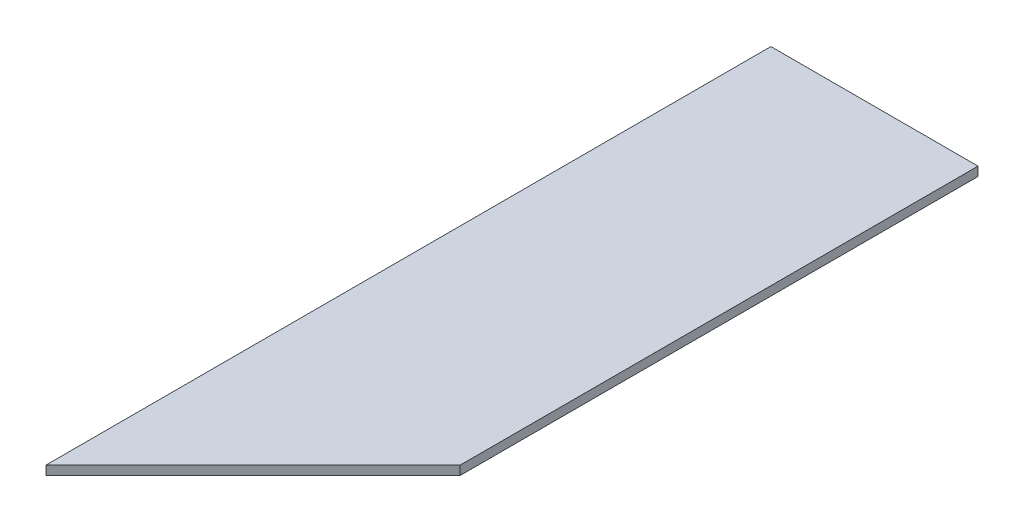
ISO-10303-21;
HEADER;
FILE_DESCRIPTION(('STEP AP214'),'2;1');
FILE_NAME('part.step','',(''),(''),'','','');
FILE_SCHEMA(('AUTOMOTIVE_DESIGN { 1 0 10303 214 1 1 1 1 }'));
ENDSEC;
DATA;
#1=APPLICATION_CONTEXT('core data for automotive mechanical design processes');
#2=APPLICATION_PROTOCOL_DEFINITION('international standard','automotive_design',2000,#1);
#3=PRODUCT_CONTEXT('',#1,'mechanical');
#4=PRODUCT('Part','Part','',(#3));
#5=PRODUCT_RELATED_PRODUCT_CATEGORY('part','',(#4));
#6=PRODUCT_DEFINITION_FORMATION('','',#4);
#7=PRODUCT_DEFINITION_CONTEXT('part definition',#1,'design');
#8=PRODUCT_DEFINITION('design','',#6,#7);
#9=PRODUCT_DEFINITION_SHAPE('','',#8);
#10=(LENGTH_UNIT() NAMED_UNIT(*) SI_UNIT(.MILLI.,.METRE.));
#11=(NAMED_UNIT(*) PLANE_ANGLE_UNIT() SI_UNIT($,.RADIAN.));
#12=(NAMED_UNIT(*) SI_UNIT($,.STERADIAN.) SOLID_ANGLE_UNIT());
#13=UNCERTAINTY_MEASURE_WITH_UNIT(LENGTH_MEASURE(1.E-05),#10,'distance_accuracy_value','');
#14=(GEOMETRIC_REPRESENTATION_CONTEXT(3) GLOBAL_UNCERTAINTY_ASSIGNED_CONTEXT((#13)) GLOBAL_UNIT_ASSIGNED_CONTEXT((#10,
#11,#12)) REPRESENTATION_CONTEXT('',''));
#15=CARTESIAN_POINT('',(0.,0.,0.));
#16=DIRECTION('',(0.,0.,1.));
#17=DIRECTION('',(1.,0.,0.));
#18=AXIS2_PLACEMENT_3D('',#15,#16,#17);
#19=CARTESIAN_POINT('',(0.,1.,0.));
#20=DIRECTION('',(-1.,0.,0.));
#21=DIRECTION('',(0.,0.,1.));
#22=AXIS2_PLACEMENT_3D('',#19,#20,#21);
#23=PLANE('',#22);
#24=DIRECTION('',(0.,0.,-1.));
#25=VECTOR('',#24,1.);
#26=CARTESIAN_POINT('',(0.,0.,0.));
#27=LINE('',#26,#25);
#28=CARTESIAN_POINT('',(0.,0.,-103.5));
#29=VERTEX_POINT('',#28);
#30=CARTESIAN_POINT('',(0.,0.,-184.));
#31=VERTEX_POINT('',#30);
#32=EDGE_CURVE('E96',#29,#31,#27,.T.);
#33=ORIENTED_EDGE('',*,*,#32,.F.);
#34=DIRECTION('',(0.,-1.,0.));
#35=VECTOR('',#34,1.);
#36=CARTESIAN_POINT('',(0.,1.,-103.5));
#37=LINE('',#36,#35);
#38=CARTESIAN_POINT('',(0.,1.,-103.5));
#39=VERTEX_POINT('',#38);
#40=EDGE_CURVE('E11',#39,#29,#37,.T.);
#41=ORIENTED_EDGE('',*,*,#40,.F.);
#42=DIRECTION('',(0.,0.,-1.));
#43=VECTOR('',#42,1.);
#44=CARTESIAN_POINT('',(0.,1.,0.));
#45=LINE('',#44,#43);
#46=CARTESIAN_POINT('',(0.,1.,-184.));
#47=VERTEX_POINT('',#46);
#48=EDGE_CURVE('E84',#39,#47,#45,.T.);
#49=ORIENTED_EDGE('',*,*,#48,.T.);
#50=DIRECTION('',(0.,-1.,0.));
#51=VECTOR('',#50,1.);
#52=CARTESIAN_POINT('',(0.,1.,-184.));
#53=LINE('',#52,#51);
#54=EDGE_CURVE('E73',#47,#31,#53,.T.);
#55=ORIENTED_EDGE('',*,*,#54,.T.);
#56=EDGE_LOOP('',(#33,#41,#49,#55));
#57=FACE_BOUND('',#56,.T.);
#58=ADVANCED_FACE('F34',(#57),#23,.T.);
#59=CARTESIAN_POINT('',(-51.7500000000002,1.,-51.750000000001));
#60=DIRECTION('',(-0.707106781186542,0.,-0.707106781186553));
#61=DIRECTION('',(-0.707106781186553,0.,0.707106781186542));
#62=AXIS2_PLACEMENT_3D('',#59,#60,#61);
#63=PLANE('',#62);
#64=DIRECTION('',(0.707106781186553,0.,-0.707106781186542));
#65=VECTOR('',#64,1.);
#66=CARTESIAN_POINT('',(-51.7500000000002,0.,-51.750000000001));
#67=LINE('',#66,#65);
#68=CARTESIAN_POINT('',(23.,0.,-126.5));
#69=VERTEX_POINT('',#68);
#70=EDGE_CURVE('E89',#29,#69,#67,.T.);
#71=ORIENTED_EDGE('',*,*,#70,.T.);
#72=DIRECTION('',(0.,-1.,0.));
#73=VECTOR('',#72,1.);
#74=CARTESIAN_POINT('',(23.,1.,-126.5));
#75=LINE('',#74,#73);
#76=CARTESIAN_POINT('',(23.,1.,-126.5));
#77=VERTEX_POINT('',#76);
#78=EDGE_CURVE('E42',#77,#69,#75,.T.);
#79=ORIENTED_EDGE('',*,*,#78,.F.);
#80=DIRECTION('',(0.707106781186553,0.,-0.707106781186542));
#81=VECTOR('',#80,1.);
#82=CARTESIAN_POINT('',(-51.7500000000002,1.,-51.750000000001));
#83=LINE('',#82,#81);
#84=EDGE_CURVE('E79',#39,#77,#83,.T.);
#85=ORIENTED_EDGE('',*,*,#84,.F.);
#86=ORIENTED_EDGE('',*,*,#40,.T.);
#87=EDGE_LOOP('',(#71,#79,#85,#86));
#88=FACE_BOUND('',#87,.T.);
#89=ADVANCED_FACE('F87',(#88),#63,.F.);
#90=CARTESIAN_POINT('',(23.,1.,0.));
#91=DIRECTION('',(-1.,0.,0.));
#92=DIRECTION('',(0.,0.,1.));
#93=AXIS2_PLACEMENT_3D('',#90,#91,#92);
#94=PLANE('',#93);
#95=DIRECTION('',(0.,0.,-1.));
#96=VECTOR('',#95,1.);
#97=CARTESIAN_POINT('',(23.,0.,0.));
#98=LINE('',#97,#96);
#99=CARTESIAN_POINT('',(23.,0.,-184.));
#100=VERTEX_POINT('',#99);
#101=EDGE_CURVE('E66',#69,#100,#98,.T.);
#102=ORIENTED_EDGE('',*,*,#101,.T.);
#103=DIRECTION('',(0.,-1.,0.));
#104=VECTOR('',#103,1.);
#105=CARTESIAN_POINT('',(23.,1.,-184.));
#106=LINE('',#105,#104);
#107=CARTESIAN_POINT('',(23.,1.,-184.));
#108=VERTEX_POINT('',#107);
#109=EDGE_CURVE('E90',#108,#100,#106,.T.);
#110=ORIENTED_EDGE('',*,*,#109,.F.);
#111=DIRECTION('',(0.,0.,-1.));
#112=VECTOR('',#111,1.);
#113=CARTESIAN_POINT('',(23.,1.,0.));
#114=LINE('',#113,#112);
#115=EDGE_CURVE('E83',#77,#108,#114,.T.);
#116=ORIENTED_EDGE('',*,*,#115,.F.);
#117=ORIENTED_EDGE('',*,*,#78,.T.);
#118=EDGE_LOOP('',(#102,#110,#116,#117));
#119=FACE_BOUND('',#118,.T.);
#120=ADVANCED_FACE('F91',(#119),#94,.F.);
#121=CARTESIAN_POINT('',(0.,1.,-184.));
#122=DIRECTION('',(0.,0.,1.));
#123=DIRECTION('',(1.,0.,0.));
#124=AXIS2_PLACEMENT_3D('',#121,#122,#123);
#125=PLANE('',#124);
#126=DIRECTION('',(-1.,0.,0.));
#127=VECTOR('',#126,1.);
#128=CARTESIAN_POINT('',(0.,0.,-184.));
#129=LINE('',#128,#127);
#130=EDGE_CURVE('E101',#100,#31,#129,.T.);
#131=ORIENTED_EDGE('',*,*,#130,.T.);
#132=ORIENTED_EDGE('',*,*,#54,.F.);
#133=DIRECTION('',(-1.,0.,0.));
#134=VECTOR('',#133,1.);
#135=CARTESIAN_POINT('',(0.,1.,-184.));
#136=LINE('',#135,#134);
#137=EDGE_CURVE('E50',#108,#47,#136,.T.);
#138=ORIENTED_EDGE('',*,*,#137,.F.);
#139=ORIENTED_EDGE('',*,*,#109,.T.);
#140=EDGE_LOOP('',(#131,#132,#138,#139));
#141=FACE_BOUND('',#140,.T.);
#142=ADVANCED_FACE('F106',(#141),#125,.F.);
#143=CARTESIAN_POINT('',(0.,1.,0.));
#144=DIRECTION('',(0.,1.,0.));
#145=DIRECTION('',(0.,0.,1.));
#146=AXIS2_PLACEMENT_3D('',#143,#144,#145);
#147=PLANE('',#146);
#148=ORIENTED_EDGE('',*,*,#48,.F.);
#149=ORIENTED_EDGE('',*,*,#84,.T.);
#150=ORIENTED_EDGE('',*,*,#115,.T.);
#151=ORIENTED_EDGE('',*,*,#137,.T.);
#152=EDGE_LOOP('',(#148,#149,#150,#151));
#153=FACE_BOUND('',#152,.T.);
#154=ADVANCED_FACE('F81',(#153),#147,.T.);
#155=CARTESIAN_POINT('',(0.,0.,0.));
#156=DIRECTION('',(0.,1.,0.));
#157=DIRECTION('',(0.,0.,1.));
#158=AXIS2_PLACEMENT_3D('',#155,#156,#157);
#159=PLANE('',#158);
#160=ORIENTED_EDGE('',*,*,#32,.T.);
#161=ORIENTED_EDGE('',*,*,#130,.F.);
#162=ORIENTED_EDGE('',*,*,#101,.F.);
#163=ORIENTED_EDGE('',*,*,#70,.F.);
#164=EDGE_LOOP('',(#160,#161,#162,#163));
#165=FACE_BOUND('',#164,.T.);
#166=ADVANCED_FACE('F108',(#165),#159,.F.);
#167=CLOSED_SHELL('',(#58,#89,#120,#142,#154,#166));
#168=MANIFOLD_SOLID_BREP('B2',#167);
#169=ADVANCED_BREP_SHAPE_REPRESENTATION('',(#18,#168),#14);
#170=SHAPE_DEFINITION_REPRESENTATION(#9,#169);
ENDSEC;
END-ISO-10303-21;
